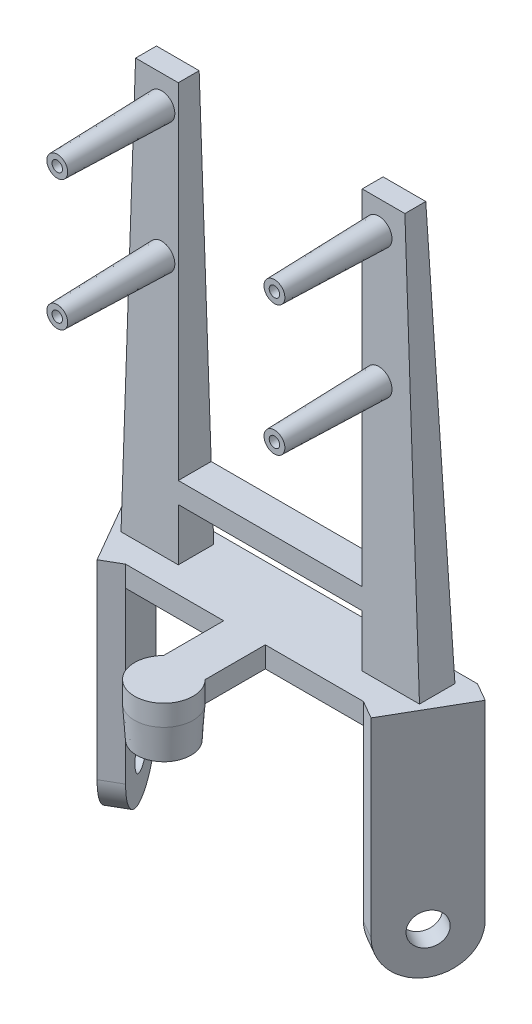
ISO-10303-21;
HEADER;
FILE_DESCRIPTION(('STEP AP214'),'2;1');
FILE_NAME('part.step','',(''),(''),'','','');
FILE_SCHEMA(('AUTOMOTIVE_DESIGN { 1 0 10303 214 1 1 1 1 }'));
ENDSEC;
DATA;
#1=APPLICATION_CONTEXT('core data for automotive mechanical design processes');
#2=APPLICATION_PROTOCOL_DEFINITION('international standard','automotive_design',2000,#1);
#3=PRODUCT_CONTEXT('',#1,'mechanical');
#4=PRODUCT('Part','Part','',(#3));
#5=PRODUCT_RELATED_PRODUCT_CATEGORY('part','',(#4));
#6=PRODUCT_DEFINITION_FORMATION('','',#4);
#7=PRODUCT_DEFINITION_CONTEXT('part definition',#1,'design');
#8=PRODUCT_DEFINITION('design','',#6,#7);
#9=PRODUCT_DEFINITION_SHAPE('','',#8);
#10=(LENGTH_UNIT() NAMED_UNIT(*) SI_UNIT(.MILLI.,.METRE.));
#11=(NAMED_UNIT(*) PLANE_ANGLE_UNIT() SI_UNIT($,.RADIAN.));
#12=(NAMED_UNIT(*) SI_UNIT($,.STERADIAN.) SOLID_ANGLE_UNIT());
#13=UNCERTAINTY_MEASURE_WITH_UNIT(LENGTH_MEASURE(1.E-05),#10,'distance_accuracy_value','');
#14=(GEOMETRIC_REPRESENTATION_CONTEXT(3) GLOBAL_UNCERTAINTY_ASSIGNED_CONTEXT((#13)) GLOBAL_UNIT_ASSIGNED_CONTEXT((#10,
#11,#12)) REPRESENTATION_CONTEXT('',''));
#15=CARTESIAN_POINT('',(0.,0.,0.));
#16=DIRECTION('',(0.,0.,1.));
#17=DIRECTION('',(1.,0.,0.));
#18=AXIS2_PLACEMENT_3D('',#15,#16,#17);
#19=CARTESIAN_POINT('',(-8.80937578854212,14.7347085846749,-24.1947583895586));
#20=DIRECTION('',(-1.,0.,0.));
#21=DIRECTION('',(0.,0.,1.));
#22=AXIS2_PLACEMENT_3D('',#19,#20,#21);
#23=PLANE('',#22);
#24=DIRECTION('',(0.,0.,-1.));
#25=VECTOR('',#24,1.);
#26=CARTESIAN_POINT('',(-8.80937578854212,23.25,-22.1947583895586));
#27=LINE('',#26,#25);
#28=CARTESIAN_POINT('',(-8.80937578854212,23.25,-22.1947583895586));
#29=VERTEX_POINT('',#28);
#30=CARTESIAN_POINT('',(-8.80937578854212,23.25,-25.4169853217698));
#31=VERTEX_POINT('',#30);
#32=EDGE_CURVE('E238',#29,#31,#27,.T.);
#33=ORIENTED_EDGE('',*,*,#32,.F.);
#34=DIRECTION('',(0.,1.,0.));
#35=VECTOR('',#34,1.);
#36=CARTESIAN_POINT('',(-8.80937578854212,14.7347085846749,-22.1947583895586));
#37=LINE('',#36,#35);
#38=CARTESIAN_POINT('',(-8.80937578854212,18.25,-22.1947583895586));
#39=VERTEX_POINT('',#38);
#40=EDGE_CURVE('E219',#39,#29,#37,.T.);
#41=ORIENTED_EDGE('',*,*,#40,.F.);
#42=DIRECTION('',(0.,0.,1.));
#43=VECTOR('',#42,1.);
#44=CARTESIAN_POINT('',(-8.80937578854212,18.25,-24.1947583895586));
#45=LINE('',#44,#43);
#46=CARTESIAN_POINT('',(-8.80937578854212,18.25,-25.5915891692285));
#47=VERTEX_POINT('',#46);
#48=EDGE_CURVE('E220',#47,#39,#45,.T.);
#49=ORIENTED_EDGE('',*,*,#48,.F.);
#50=DIRECTION('',(0.,0.999390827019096,0.034899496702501));
#51=VECTOR('',#50,1.);
#52=CARTESIAN_POINT('',(-8.80937578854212,58.25,-24.1947583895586));
#53=LINE('',#52,#51);
#54=EDGE_CURVE('E55',#31,#47,#53,.F.);
#55=ORIENTED_EDGE('',*,*,#54,.F.);
#56=EDGE_LOOP('',(#33,#41,#49,#55));
#57=FACE_BOUND('',#56,.T.);
#58=ADVANCED_FACE('F39',(#57),#23,.F.);
#59=DIRECTION('',(0.,0.,1.));
#60=VECTOR('',#59,1.);
#61=CARTESIAN_POINT('',(-8.80937578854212,25.2480319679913,-25.3472125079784));
#62=LINE('',#61,#60);
#63=CARTESIAN_POINT('',(-8.80937578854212,25.2480319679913,-25.3472125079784));
#64=VERTEX_POINT('',#63);
#65=CARTESIAN_POINT('',(-8.80937578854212,25.2480319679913,-22.1947583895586));
#66=VERTEX_POINT('',#65);
#67=EDGE_CURVE('E63',#64,#66,#62,.T.);
#68=ORIENTED_EDGE('',*,*,#67,.F.);
#69=CARTESIAN_POINT('',(-8.80937578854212,58.25,-24.1947583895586));
#70=VERTEX_POINT('',#69);
#71=EDGE_CURVE('E270',#70,#64,#53,.F.);
#72=ORIENTED_EDGE('',*,*,#71,.F.);
#73=DIRECTION('',(0.,0.,-1.));
#74=VECTOR('',#73,1.);
#75=CARTESIAN_POINT('',(-8.80937578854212,58.25,0.));
#76=LINE('',#75,#74);
#77=CARTESIAN_POINT('',(-8.80937578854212,58.25,-22.1947583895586));
#78=VERTEX_POINT('',#77);
#79=EDGE_CURVE('E215',#78,#70,#76,.T.);
#80=ORIENTED_EDGE('',*,*,#79,.F.);
#81=EDGE_CURVE('E211',#66,#78,#37,.T.);
#82=ORIENTED_EDGE('',*,*,#81,.F.);
#83=EDGE_LOOP('',(#68,#72,#80,#82));
#84=FACE_BOUND('',#83,.T.);
#85=ADVANCED_FACE('F213',(#84),#23,.F.);
#86=CARTESIAN_POINT('',(8.80937578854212,14.7347085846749,-24.1947583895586));
#87=DIRECTION('',(-1.,0.,0.));
#88=DIRECTION('',(0.,0.,1.));
#89=AXIS2_PLACEMENT_3D('',#86,#87,#88);
#90=PLANE('',#89);
#91=DIRECTION('',(0.,1.,0.));
#92=VECTOR('',#91,1.);
#93=CARTESIAN_POINT('',(8.80937578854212,14.7347085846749,-22.1947583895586));
#94=LINE('',#93,#92);
#95=CARTESIAN_POINT('',(8.80937578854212,18.25,-22.1947583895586));
#96=VERTEX_POINT('',#95);
#97=CARTESIAN_POINT('',(8.80937578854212,23.25,-22.1947583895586));
#98=VERTEX_POINT('',#97);
#99=EDGE_CURVE('E257',#96,#98,#94,.T.);
#100=ORIENTED_EDGE('',*,*,#99,.T.);
#101=DIRECTION('',(0.,0.,-1.));
#102=VECTOR('',#101,1.);
#103=CARTESIAN_POINT('',(8.80937578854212,23.25,-24.1947583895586));
#104=LINE('',#103,#102);
#105=CARTESIAN_POINT('',(8.80937578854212,23.25,-25.4169853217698));
#106=VERTEX_POINT('',#105);
#107=EDGE_CURVE('E11',#98,#106,#104,.T.);
#108=ORIENTED_EDGE('',*,*,#107,.T.);
#109=DIRECTION('',(0.,0.999390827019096,0.034899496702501));
#110=VECTOR('',#109,1.);
#111=CARTESIAN_POINT('',(8.80937578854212,58.25,-24.1947583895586));
#112=LINE('',#111,#110);
#113=CARTESIAN_POINT('',(8.80937578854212,18.25,-25.5915891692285));
#114=VERTEX_POINT('',#113);
#115=EDGE_CURVE('E261',#114,#106,#112,.T.);
#116=ORIENTED_EDGE('',*,*,#115,.F.);
#117=DIRECTION('',(0.,0.,1.));
#118=VECTOR('',#117,1.);
#119=CARTESIAN_POINT('',(8.80937578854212,18.25,-24.1947583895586));
#120=LINE('',#119,#118);
#121=EDGE_CURVE('E253',#114,#96,#120,.T.);
#122=ORIENTED_EDGE('',*,*,#121,.T.);
#123=EDGE_LOOP('',(#100,#108,#116,#122));
#124=FACE_BOUND('',#123,.T.);
#125=ADVANCED_FACE('F602',(#124),#90,.T.);
#126=CARTESIAN_POINT('',(8.80937578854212,25.2480319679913,-25.3472125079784));
#127=VERTEX_POINT('',#126);
#128=CARTESIAN_POINT('',(8.80937578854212,58.25,-24.1947583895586));
#129=VERTEX_POINT('',#128);
#130=EDGE_CURVE('E256',#127,#129,#112,.T.);
#131=ORIENTED_EDGE('',*,*,#130,.F.);
#132=DIRECTION('',(0.,0.,1.));
#133=VECTOR('',#132,1.);
#134=CARTESIAN_POINT('',(8.80937578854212,25.2480319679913,-24.1947583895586));
#135=LINE('',#134,#133);
#136=CARTESIAN_POINT('',(8.80937578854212,25.2480319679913,-22.1947583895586));
#137=VERTEX_POINT('',#136);
#138=EDGE_CURVE('E48',#127,#137,#135,.T.);
#139=ORIENTED_EDGE('',*,*,#138,.T.);
#140=CARTESIAN_POINT('',(8.80937578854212,58.25,-22.1947583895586));
#141=VERTEX_POINT('',#140);
#142=EDGE_CURVE('E228',#137,#141,#94,.T.);
#143=ORIENTED_EDGE('',*,*,#142,.T.);
#144=DIRECTION('',(0.,0.,-1.));
#145=VECTOR('',#144,1.);
#146=CARTESIAN_POINT('',(8.80937578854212,58.25,0.));
#147=LINE('',#146,#145);
#148=EDGE_CURVE('E576',#141,#129,#147,.T.);
#149=ORIENTED_EDGE('',*,*,#148,.T.);
#150=EDGE_LOOP('',(#131,#139,#143,#149));
#151=FACE_BOUND('',#150,.T.);
#152=ADVANCED_FACE('F582',(#151),#90,.T.);
#153=CARTESIAN_POINT('',(0.,58.25,0.));
#154=DIRECTION('',(0.,-1.,0.));
#155=DIRECTION('',(0.,0.,-1.));
#156=AXIS2_PLACEMENT_3D('',#153,#154,#155);
#157=PLANE('',#156);
#158=ORIENTED_EDGE('',*,*,#148,.F.);
#159=DIRECTION('',(-1.,0.,0.));
#160=VECTOR('',#159,1.);
#161=CARTESIAN_POINT('',(12.8992245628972,58.25,-22.1947583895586));
#162=LINE('',#161,#160);
#163=CARTESIAN_POINT('',(12.8992245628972,58.25,-22.1947583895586));
#164=VERTEX_POINT('',#163);
#165=EDGE_CURVE('E306',#164,#141,#162,.T.);
#166=ORIENTED_EDGE('',*,*,#165,.F.);
#167=DIRECTION('',(0.,0.,1.));
#168=VECTOR('',#167,1.);
#169=CARTESIAN_POINT('',(12.8992245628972,58.25,-22.1947583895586));
#170=LINE('',#169,#168);
#171=CARTESIAN_POINT('',(12.8992245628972,58.25,-24.1947583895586));
#172=VERTEX_POINT('',#171);
#173=EDGE_CURVE('E298',#172,#164,#170,.T.);
#174=ORIENTED_EDGE('',*,*,#173,.F.);
#175=DIRECTION('',(1.,0.,0.));
#176=VECTOR('',#175,1.);
#177=CARTESIAN_POINT('',(12.8992245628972,58.25,-24.1947583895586));
#178=LINE('',#177,#176);
#179=EDGE_CURVE('E302',#129,#172,#178,.T.);
#180=ORIENTED_EDGE('',*,*,#179,.F.);
#181=EDGE_LOOP('',(#158,#166,#174,#180));
#182=FACE_BOUND('',#181,.T.);
#183=ADVANCED_FACE('F616',(#182),#157,.F.);
#184=CARTESIAN_POINT('',(0.,18.25,-12.));
#185=DIRECTION('',(0.,-1.,0.));
#186=DIRECTION('',(0.,0.,-1.));
#187=AXIS2_PLACEMENT_3D('',#184,#185,#186);
#188=PLANE('',#187);
#189=ORIENTED_EDGE('',*,*,#121,.F.);
#190=DIRECTION('',(1.,0.,0.));
#191=VECTOR('',#190,1.);
#192=CARTESIAN_POINT('',(0.,18.25,-25.5915891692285));
#193=LINE('',#192,#191);
#194=CARTESIAN_POINT('',(14.2960553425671,18.25,-25.5915891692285));
#195=VERTEX_POINT('',#194);
#196=EDGE_CURVE('E313',#114,#195,#193,.T.);
#197=ORIENTED_EDGE('',*,*,#196,.T.);
#198=DIRECTION('',(0.,0.,1.));
#199=VECTOR('',#198,1.);
#200=CARTESIAN_POINT('',(14.2960553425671,18.25,-12.));
#201=LINE('',#200,#199);
#202=CARTESIAN_POINT('',(14.2960553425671,18.25,-22.1947583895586));
#203=VERTEX_POINT('',#202);
#204=EDGE_CURVE('E297',#195,#203,#201,.T.);
#205=ORIENTED_EDGE('',*,*,#204,.T.);
#206=DIRECTION('',(-1.,0.,0.));
#207=VECTOR('',#206,1.);
#208=CARTESIAN_POINT('',(12.8992245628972,18.25,-22.1947583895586));
#209=LINE('',#208,#207);
#210=EDGE_CURVE('E303',#203,#96,#209,.T.);
#211=ORIENTED_EDGE('',*,*,#210,.T.);
#212=EDGE_LOOP('',(#189,#197,#205,#211));
#213=FACE_BOUND('',#212,.T.);
#214=DIRECTION('',(0.500000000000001,0.,0.866025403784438));
#215=VECTOR('',#214,1.);
#216=CARTESIAN_POINT('',(-13.1235508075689,18.25,-18.7306567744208));
#217=LINE('',#216,#215);
#218=CARTESIAN_POINT('',(-17.1235508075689,18.25,-25.6588600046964));
#219=VERTEX_POINT('',#218);
#220=CARTESIAN_POINT('',(-13.1235508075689,18.25,-18.7306567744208));
#221=VERTEX_POINT('',#220);
#222=EDGE_CURVE('E399',#219,#221,#217,.T.);
#223=ORIENTED_EDGE('',*,*,#222,.T.);
#224=DIRECTION('',(0.866025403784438,0.,-0.500000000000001));
#225=VECTOR('',#224,1.);
#226=CARTESIAN_POINT('',(-11.3915,18.25,-19.7306567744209));
#227=LINE('',#226,#225);
#228=CARTESIAN_POINT('',(-11.3915,18.25,-19.7306567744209));
#229=VERTEX_POINT('',#228);
#230=EDGE_CURVE('E403',#221,#229,#227,.T.);
#231=ORIENTED_EDGE('',*,*,#230,.T.);
#232=DIRECTION('',(1.,0.,0.));
#233=VECTOR('',#232,1.);
#234=CARTESIAN_POINT('',(-11.3915,18.25,-19.7306567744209));
#235=LINE('',#234,#233);
#236=CARTESIAN_POINT('',(-1.99408198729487,18.25,-19.7306567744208));
#237=VERTEX_POINT('',#236);
#238=EDGE_CURVE('E407',#229,#237,#235,.T.);
#239=ORIENTED_EDGE('',*,*,#238,.T.);
#240=DIRECTION('',(0.,0.,1.));
#241=VECTOR('',#240,1.);
#242=CARTESIAN_POINT('',(-1.99408198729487,18.25,-13.96561365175));
#243=LINE('',#242,#241);
#244=CARTESIAN_POINT('',(-1.99408198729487,18.25,-13.96561365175));
#245=VERTEX_POINT('',#244);
#246=EDGE_CURVE('E410',#237,#245,#243,.T.);
#247=ORIENTED_EDGE('',*,*,#246,.T.);
#248=CARTESIAN_POINT('',(0.,18.25,-12.));
#249=DIRECTION('',(0.,1.,0.));
#250=DIRECTION('',(0.,0.,-1.));
#251=AXIS2_PLACEMENT_3D('',#248,#249,#250);
#252=CIRCLE('',#251,2.8);
#253=CARTESIAN_POINT('',(1.99408198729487,18.25,-13.96561365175));
#254=VERTEX_POINT('',#253);
#255=EDGE_CURVE('E413',#245,#254,#252,.T.);
#256=ORIENTED_EDGE('',*,*,#255,.T.);
#257=DIRECTION('',(0.,0.,-1.));
#258=VECTOR('',#257,1.);
#259=CARTESIAN_POINT('',(1.99408198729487,18.25,-19.7306567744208));
#260=LINE('',#259,#258);
#261=CARTESIAN_POINT('',(1.99408198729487,18.25,-19.7306567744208));
#262=VERTEX_POINT('',#261);
#263=EDGE_CURVE('E416',#254,#262,#260,.T.);
#264=ORIENTED_EDGE('',*,*,#263,.T.);
#265=DIRECTION('',(1.,0.,0.));
#266=VECTOR('',#265,1.);
#267=CARTESIAN_POINT('',(1.99408198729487,18.25,-19.7306567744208));
#268=LINE('',#267,#266);
#269=CARTESIAN_POINT('',(11.3915,18.25,-19.7306567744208));
#270=VERTEX_POINT('',#269);
#271=EDGE_CURVE('E419',#262,#270,#268,.T.);
#272=ORIENTED_EDGE('',*,*,#271,.T.);
#273=DIRECTION('',(0.866025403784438,0.,0.500000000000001));
#274=VECTOR('',#273,1.);
#275=CARTESIAN_POINT('',(13.1235508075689,18.25,-18.7306567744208));
#276=LINE('',#275,#274);
#277=CARTESIAN_POINT('',(13.1235508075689,18.25,-18.7306567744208));
#278=VERTEX_POINT('',#277);
#279=EDGE_CURVE('E422',#270,#278,#276,.T.);
#280=ORIENTED_EDGE('',*,*,#279,.T.);
#281=DIRECTION('',(0.500000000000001,0.,-0.866025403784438));
#282=VECTOR('',#281,1.);
#283=CARTESIAN_POINT('',(17.1235508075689,18.25,-25.6588600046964));
#284=LINE('',#283,#282);
#285=CARTESIAN_POINT('',(17.1235508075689,18.25,-25.6588600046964));
#286=VERTEX_POINT('',#285);
#287=EDGE_CURVE('E426',#278,#286,#284,.T.);
#288=ORIENTED_EDGE('',*,*,#287,.T.);
#289=DIRECTION('',(-0.866025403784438,0.,-0.5));
#290=VECTOR('',#289,1.);
#291=CARTESIAN_POINT('',(15.3915,18.25,-26.6588600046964));
#292=LINE('',#291,#290);
#293=CARTESIAN_POINT('',(15.3915,18.25,-26.6588600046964));
#294=VERTEX_POINT('',#293);
#295=EDGE_CURVE('E430',#286,#294,#292,.T.);
#296=ORIENTED_EDGE('',*,*,#295,.T.);
#297=DIRECTION('',(-1.,0.,0.));
#298=VECTOR('',#297,1.);
#299=CARTESIAN_POINT('',(-15.3915,18.25,-26.6588600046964));
#300=LINE('',#299,#298);
#301=CARTESIAN_POINT('',(-15.3915,18.25,-26.6588600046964));
#302=VERTEX_POINT('',#301);
#303=EDGE_CURVE('E433',#294,#302,#300,.T.);
#304=ORIENTED_EDGE('',*,*,#303,.T.);
#305=DIRECTION('',(-0.866025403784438,0.,0.5));
#306=VECTOR('',#305,1.);
#307=CARTESIAN_POINT('',(-17.1235508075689,18.25,-25.6588600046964));
#308=LINE('',#307,#306);
#309=EDGE_CURVE('E436',#302,#219,#308,.T.);
#310=ORIENTED_EDGE('',*,*,#309,.T.);
#311=EDGE_LOOP('',(#223,#231,#239,#247,#256,#264,#272,#280,#288,#296,#304,#310));
#312=FACE_BOUND('',#311,.T.);
#313=DIRECTION('',(1.,0.,0.));
#314=VECTOR('',#313,1.);
#315=CARTESIAN_POINT('',(-12.8992245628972,18.25,-22.1947583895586));
#316=LINE('',#315,#314);
#317=CARTESIAN_POINT('',(-14.2960553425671,18.25,-22.1947583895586));
#318=VERTEX_POINT('',#317);
#319=EDGE_CURVE('E339',#318,#39,#316,.T.);
#320=ORIENTED_EDGE('',*,*,#319,.F.);
#321=DIRECTION('',(0.,0.,-1.));
#322=VECTOR('',#321,1.);
#323=CARTESIAN_POINT('',(-14.2960553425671,18.25,-12.));
#324=LINE('',#323,#322);
#325=CARTESIAN_POINT('',(-14.2960553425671,18.25,-25.5915891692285));
#326=VERTEX_POINT('',#325);
#327=EDGE_CURVE('E345',#326,#318,#324,.F.);
#328=ORIENTED_EDGE('',*,*,#327,.F.);
#329=DIRECTION('',(1.,0.,0.));
#330=VECTOR('',#329,1.);
#331=CARTESIAN_POINT('',(0.,18.25,-25.5915891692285));
#332=LINE('',#331,#330);
#333=EDGE_CURVE('E355',#47,#326,#332,.F.);
#334=ORIENTED_EDGE('',*,*,#333,.F.);
#335=ORIENTED_EDGE('',*,*,#48,.T.);
#336=EDGE_LOOP('',(#320,#328,#334,#335));
#337=FACE_BOUND('',#336,.T.);
#338=ADVANCED_FACE('F597',(#213,#312,#337),#188,.F.);
#339=CARTESIAN_POINT('',(15.1235508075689,0.,-22.1947583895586));
#340=DIRECTION('',(-0.866025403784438,0.,-0.500000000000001));
#341=DIRECTION('',(-0.500000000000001,0.,0.866025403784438));
#342=AXIS2_PLACEMENT_3D('',#339,#340,#341);
#343=CYLINDRICAL_SURFACE('',#342,4.);
#344=CARTESIAN_POINT('',(13.3915,0.,-23.1947583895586));
#345=DIRECTION('',(0.866025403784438,0.,0.500000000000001));
#346=DIRECTION('',(-0.500000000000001,0.,0.866025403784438));
#347=AXIS2_PLACEMENT_3D('',#344,#345,#346);
#348=CIRCLE('',#347,4.);
#349=CARTESIAN_POINT('',(11.3915,0.,-19.7306567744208));
#350=VERTEX_POINT('',#349);
#351=CARTESIAN_POINT('',(15.3915,0.,-26.6588600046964));
#352=VERTEX_POINT('',#351);
#353=EDGE_CURVE('E502',#350,#352,#348,.T.);
#354=ORIENTED_EDGE('',*,*,#353,.T.);
#355=DIRECTION('',(-0.866025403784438,0.,-0.500000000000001));
#356=VECTOR('',#355,1.);
#357=CARTESIAN_POINT('',(17.1235508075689,0.,-25.6588600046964));
#358=LINE('',#357,#356);
#359=CARTESIAN_POINT('',(17.1235508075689,0.,-25.6588600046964));
#360=VERTEX_POINT('',#359);
#361=EDGE_CURVE('E533',#360,#352,#358,.T.);
#362=ORIENTED_EDGE('',*,*,#361,.F.);
#363=CARTESIAN_POINT('',(15.1235508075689,0.,-22.1947583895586));
#364=DIRECTION('',(0.866025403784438,0.,0.500000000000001));
#365=DIRECTION('',(-0.500000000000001,0.,0.866025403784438));
#366=AXIS2_PLACEMENT_3D('',#363,#364,#365);
#367=CIRCLE('',#366,4.);
#368=CARTESIAN_POINT('',(13.1235508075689,0.,-18.7306567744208));
#369=VERTEX_POINT('',#368);
#370=EDGE_CURVE('E506',#369,#360,#367,.T.);
#371=ORIENTED_EDGE('',*,*,#370,.F.);
#372=DIRECTION('',(-0.866025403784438,0.,-0.500000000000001));
#373=VECTOR('',#372,1.);
#374=CARTESIAN_POINT('',(13.1235508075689,0.,-18.7306567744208));
#375=LINE('',#374,#373);
#376=EDGE_CURVE('E517',#369,#350,#375,.T.);
#377=ORIENTED_EDGE('',*,*,#376,.T.);
#378=EDGE_LOOP('',(#354,#362,#371,#377));
#379=FACE_BOUND('',#378,.T.);
#380=ADVANCED_FACE('F623',(#379),#343,.T.);
#381=CARTESIAN_POINT('',(17.1235508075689,16.25,-25.6588600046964));
#382=DIRECTION('',(-0.500000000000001,0.,0.866025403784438));
#383=DIRECTION('',(0.866025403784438,0.,0.500000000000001));
#384=AXIS2_PLACEMENT_3D('',#381,#382,#383);
#385=PLANE('',#384);
#386=DIRECTION('',(0.,1.,0.));
#387=VECTOR('',#386,1.);
#388=CARTESIAN_POINT('',(15.3915,16.25,-26.6588600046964));
#389=LINE('',#388,#387);
#390=CARTESIAN_POINT('',(15.3915,16.25,-26.6588600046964));
#391=VERTEX_POINT('',#390);
#392=EDGE_CURVE('E521',#352,#391,#389,.T.);
#393=ORIENTED_EDGE('',*,*,#392,.T.);
#394=DIRECTION('',(0.,-1.,0.));
#395=VECTOR('',#394,1.);
#396=CARTESIAN_POINT('',(15.3915,18.25,-26.6588600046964));
#397=LINE('',#396,#395);
#398=EDGE_CURVE('E466',#294,#391,#397,.T.);
#399=ORIENTED_EDGE('',*,*,#398,.F.);
#400=ORIENTED_EDGE('',*,*,#295,.F.);
#401=DIRECTION('',(0.,1.,0.));
#402=VECTOR('',#401,1.);
#403=CARTESIAN_POINT('',(17.1235508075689,16.25,-25.6588600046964));
#404=LINE('',#403,#402);
#405=EDGE_CURVE('E510',#360,#286,#404,.T.);
#406=ORIENTED_EDGE('',*,*,#405,.F.);
#407=ORIENTED_EDGE('',*,*,#361,.T.);
#408=EDGE_LOOP('',(#393,#399,#400,#406,#407));
#409=FACE_BOUND('',#408,.T.);
#410=ADVANCED_FACE('F755',(#409),#385,.F.);
#411=CARTESIAN_POINT('',(13.1235508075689,0.,-18.7306567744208));
#412=DIRECTION('',(0.500000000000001,0.,-0.866025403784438));
#413=DIRECTION('',(-0.866025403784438,0.,-0.500000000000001));
#414=AXIS2_PLACEMENT_3D('',#411,#412,#413);
#415=PLANE('',#414);
#416=DIRECTION('',(0.,-1.,0.));
#417=VECTOR('',#416,1.);
#418=CARTESIAN_POINT('',(11.3915,0.,-19.7306567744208));
#419=LINE('',#418,#417);
#420=CARTESIAN_POINT('',(11.3915,16.25,-19.7306567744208));
#421=VERTEX_POINT('',#420);
#422=EDGE_CURVE('E511',#421,#350,#419,.T.);
#423=ORIENTED_EDGE('',*,*,#422,.T.);
#424=ORIENTED_EDGE('',*,*,#376,.F.);
#425=DIRECTION('',(0.,-1.,0.));
#426=VECTOR('',#425,1.);
#427=CARTESIAN_POINT('',(13.1235508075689,0.,-18.7306567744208));
#428=LINE('',#427,#426);
#429=EDGE_CURVE('E514',#278,#369,#428,.T.);
#430=ORIENTED_EDGE('',*,*,#429,.F.);
#431=ORIENTED_EDGE('',*,*,#279,.F.);
#432=DIRECTION('',(0.,-1.,0.));
#433=VECTOR('',#432,1.);
#434=CARTESIAN_POINT('',(11.3915,18.25,-19.7306567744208));
#435=LINE('',#434,#433);
#436=EDGE_CURVE('E470',#270,#421,#435,.T.);
#437=ORIENTED_EDGE('',*,*,#436,.T.);
#438=EDGE_LOOP('',(#423,#424,#430,#431,#437));
#439=FACE_BOUND('',#438,.T.);
#440=ADVANCED_FACE('F748',(#439),#415,.F.);
#441=CARTESIAN_POINT('',(15.1235508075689,0.,-22.1947583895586));
#442=DIRECTION('',(-0.866025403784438,0.,-0.500000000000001));
#443=DIRECTION('',(-0.500000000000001,0.,0.866025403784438));
#444=AXIS2_PLACEMENT_3D('',#441,#442,#443);
#445=PLANE('',#444);
#446=CARTESIAN_POINT('',(15.1235508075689,0.,-22.1947583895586));
#447=DIRECTION('',(-0.866025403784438,0.,-0.500000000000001));
#448=DIRECTION('',(-0.500000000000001,0.,0.866025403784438));
#449=AXIS2_PLACEMENT_3D('',#446,#447,#448);
#450=CIRCLE('',#449,1.55);
#451=CARTESIAN_POINT('',(14.3485508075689,0.,-20.8524190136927));
#452=VERTEX_POINT('',#451);
#453=EDGE_CURVE('E498',#452,#452,#450,.T.);
#454=ORIENTED_EDGE('',*,*,#453,.T.);
#455=EDGE_LOOP('',(#454));
#456=FACE_BOUND('',#455,.T.);
#457=ORIENTED_EDGE('',*,*,#370,.T.);
#458=ORIENTED_EDGE('',*,*,#405,.T.);
#459=ORIENTED_EDGE('',*,*,#287,.F.);
#460=ORIENTED_EDGE('',*,*,#429,.T.);
#461=EDGE_LOOP('',(#457,#458,#459,#460));
#462=FACE_BOUND('',#461,.T.);
#463=ADVANCED_FACE('F745',(#456,#462),#445,.F.);
#464=CARTESIAN_POINT('',(13.3915,0.,-23.1947583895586));
#465=DIRECTION('',(-0.866025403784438,0.,-0.500000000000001));
#466=DIRECTION('',(-0.500000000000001,0.,0.866025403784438));
#467=AXIS2_PLACEMENT_3D('',#464,#465,#466);
#468=PLANE('',#467);
#469=CARTESIAN_POINT('',(13.3915,0.,-23.1947583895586));
#470=DIRECTION('',(-0.866025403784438,0.,-0.500000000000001));
#471=DIRECTION('',(-0.500000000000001,0.,0.866025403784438));
#472=AXIS2_PLACEMENT_3D('',#469,#470,#471);
#473=CIRCLE('',#472,1.55);
#474=CARTESIAN_POINT('',(12.6165,0.,-21.8524190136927));
#475=VERTEX_POINT('',#474);
#476=EDGE_CURVE('E497',#475,#475,#473,.T.);
#477=ORIENTED_EDGE('',*,*,#476,.F.);
#478=EDGE_LOOP('',(#477));
#479=FACE_BOUND('',#478,.T.);
#480=ORIENTED_EDGE('',*,*,#353,.F.);
#481=ORIENTED_EDGE('',*,*,#422,.F.);
#482=DIRECTION('',(-0.500000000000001,0.,0.866025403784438));
#483=VECTOR('',#482,1.);
#484=CARTESIAN_POINT('',(11.3915,16.25,-19.7306567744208));
#485=LINE('',#484,#483);
#486=EDGE_CURVE('E524',#391,#421,#485,.T.);
#487=ORIENTED_EDGE('',*,*,#486,.F.);
#488=ORIENTED_EDGE('',*,*,#392,.F.);
#489=EDGE_LOOP('',(#480,#481,#487,#488));
#490=FACE_BOUND('',#489,.T.);
#491=ADVANCED_FACE('F743',(#479,#490),#468,.T.);
#492=CARTESIAN_POINT('',(15.1235508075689,0.,-22.1947583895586));
#493=DIRECTION('',(-0.866025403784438,0.,-0.500000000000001));
#494=DIRECTION('',(-0.500000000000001,0.,0.866025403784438));
#495=AXIS2_PLACEMENT_3D('',#492,#493,#494);
#496=CYLINDRICAL_SURFACE('',#495,1.55);
#497=ORIENTED_EDGE('',*,*,#453,.F.);
#498=EDGE_LOOP('',(#497));
#499=FACE_BOUND('',#498,.T.);
#500=ORIENTED_EDGE('',*,*,#476,.T.);
#501=EDGE_LOOP('',(#500));
#502=FACE_BOUND('',#501,.T.);
#503=ADVANCED_FACE('F739',(#499,#502),#496,.F.);
#504=CARTESIAN_POINT('',(-13.1235508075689,18.25,-18.7306567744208));
#505=DIRECTION('',(0.866025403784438,0.,-0.500000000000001));
#506=DIRECTION('',(-0.500000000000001,0.,-0.866025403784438));
#507=AXIS2_PLACEMENT_3D('',#504,#505,#506);
#508=PLANE('',#507);
#509=DIRECTION('',(0.,-1.,0.));
#510=VECTOR('',#509,1.);
#511=CARTESIAN_POINT('',(-17.1235508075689,18.25,-25.6588600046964));
#512=LINE('',#511,#510);
#513=CARTESIAN_POINT('',(-17.1235508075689,0.,-25.6588600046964));
#514=VERTEX_POINT('',#513);
#515=EDGE_CURVE('E439',#219,#514,#512,.T.);
#516=ORIENTED_EDGE('',*,*,#515,.T.);
#517=CARTESIAN_POINT('',(-15.1235508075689,0.,-22.1947583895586));
#518=DIRECTION('',(-0.866025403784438,0.,0.500000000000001));
#519=DIRECTION('',(-0.500000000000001,0.,-0.866025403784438));
#520=AXIS2_PLACEMENT_3D('',#517,#518,#519);
#521=CIRCLE('',#520,4.);
#522=CARTESIAN_POINT('',(-13.1235508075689,0.,-18.7306567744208));
#523=VERTEX_POINT('',#522);
#524=EDGE_CURVE('E373',#514,#523,#521,.T.);
#525=ORIENTED_EDGE('',*,*,#524,.T.);
#526=DIRECTION('',(0.,-1.,0.));
#527=VECTOR('',#526,1.);
#528=CARTESIAN_POINT('',(-13.1235508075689,18.25,-18.7306567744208));
#529=LINE('',#528,#527);
#530=EDGE_CURVE('E494',#221,#523,#529,.T.);
#531=ORIENTED_EDGE('',*,*,#530,.F.);
#532=ORIENTED_EDGE('',*,*,#222,.F.);
#533=EDGE_LOOP('',(#516,#525,#531,#532));
#534=FACE_BOUND('',#533,.T.);
#535=CARTESIAN_POINT('',(-15.1235508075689,0.,-22.1947583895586));
#536=DIRECTION('',(0.866025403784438,0.,-0.500000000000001));
#537=DIRECTION('',(-0.500000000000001,0.,-0.866025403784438));
#538=AXIS2_PLACEMENT_3D('',#535,#536,#537);
#539=CIRCLE('',#538,1.55);
#540=CARTESIAN_POINT('',(-15.8985508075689,0.,-23.5370977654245));
#541=VERTEX_POINT('',#540);
#542=EDGE_CURVE('E365',#541,#541,#539,.T.);
#543=ORIENTED_EDGE('',*,*,#542,.T.);
#544=EDGE_LOOP('',(#543));
#545=FACE_BOUND('',#544,.T.);
#546=ADVANCED_FACE('F735',(#534,#545),#508,.F.);
#547=CARTESIAN_POINT('',(-11.3915,18.25,-19.7306567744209));
#548=DIRECTION('',(-0.500000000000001,0.,-0.866025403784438));
#549=DIRECTION('',(-0.866025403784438,0.,0.500000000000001));
#550=AXIS2_PLACEMENT_3D('',#547,#548,#549);
#551=PLANE('',#550);
#552=ORIENTED_EDGE('',*,*,#530,.T.);
#553=DIRECTION('',(0.866025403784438,0.,-0.500000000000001));
#554=VECTOR('',#553,1.);
#555=CARTESIAN_POINT('',(-13.1235508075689,0.,-18.7306567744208));
#556=LINE('',#555,#554);
#557=CARTESIAN_POINT('',(-11.3915,0.,-19.7306567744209));
#558=VERTEX_POINT('',#557);
#559=EDGE_CURVE('E394',#523,#558,#556,.T.);
#560=ORIENTED_EDGE('',*,*,#559,.T.);
#561=DIRECTION('',(0.,1.,0.));
#562=VECTOR('',#561,1.);
#563=CARTESIAN_POINT('',(-11.3915,0.,-19.7306567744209));
#564=LINE('',#563,#562);
#565=CARTESIAN_POINT('',(-11.3915,16.25,-19.7306567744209));
#566=VERTEX_POINT('',#565);
#567=EDGE_CURVE('E382',#558,#566,#564,.T.);
#568=ORIENTED_EDGE('',*,*,#567,.T.);
#569=DIRECTION('',(0.,-1.,0.));
#570=VECTOR('',#569,1.);
#571=CARTESIAN_POINT('',(-11.3915,18.25,-19.7306567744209));
#572=LINE('',#571,#570);
#573=EDGE_CURVE('E490',#229,#566,#572,.T.);
#574=ORIENTED_EDGE('',*,*,#573,.F.);
#575=ORIENTED_EDGE('',*,*,#230,.F.);
#576=EDGE_LOOP('',(#552,#560,#568,#574,#575));
#577=FACE_BOUND('',#576,.T.);
#578=ADVANCED_FACE('F731',(#577),#551,.F.);
#579=CARTESIAN_POINT('',(-11.3915,18.25,-19.7306567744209));
#580=DIRECTION('',(0.,0.,-1.));
#581=DIRECTION('',(-1.,0.,0.));
#582=AXIS2_PLACEMENT_3D('',#579,#580,#581);
#583=PLANE('',#582);
#584=DIRECTION('',(1.,0.,0.));
#585=VECTOR('',#584,1.);
#586=CARTESIAN_POINT('',(-11.3915,16.25,-19.7306567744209));
#587=LINE('',#586,#585);
#588=CARTESIAN_POINT('',(-1.99408198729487,16.25,-19.7306567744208));
#589=VERTEX_POINT('',#588);
#590=EDGE_CURVE('E398',#566,#589,#587,.T.);
#591=ORIENTED_EDGE('',*,*,#590,.T.);
#592=DIRECTION('',(0.,-1.,0.));
#593=VECTOR('',#592,1.);
#594=CARTESIAN_POINT('',(-1.99408198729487,18.25,-19.7306567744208));
#595=LINE('',#594,#593);
#596=EDGE_CURVE('E486',#237,#589,#595,.T.);
#597=ORIENTED_EDGE('',*,*,#596,.F.);
#598=ORIENTED_EDGE('',*,*,#238,.F.);
#599=ORIENTED_EDGE('',*,*,#573,.T.);
#600=EDGE_LOOP('',(#591,#597,#598,#599));
#601=FACE_BOUND('',#600,.T.);
#602=ADVANCED_FACE('F727',(#601),#583,.F.);
#603=CARTESIAN_POINT('',(-1.99408198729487,18.25,-13.96561365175));
#604=DIRECTION('',(1.,0.,0.));
#605=DIRECTION('',(0.,0.,-1.));
#606=AXIS2_PLACEMENT_3D('',#603,#604,#605);
#607=PLANE('',#606);
#608=DIRECTION('',(0.,0.,1.));
#609=VECTOR('',#608,1.);
#610=CARTESIAN_POINT('',(-1.99408198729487,16.25,-13.96561365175));
#611=LINE('',#610,#609);
#612=CARTESIAN_POINT('',(-1.99408198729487,16.25,-13.96561365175));
#613=VERTEX_POINT('',#612);
#614=EDGE_CURVE('E442',#589,#613,#611,.T.);
#615=ORIENTED_EDGE('',*,*,#614,.T.);
#616=DIRECTION('',(0.,-1.,0.));
#617=VECTOR('',#616,1.);
#618=CARTESIAN_POINT('',(-1.99408198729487,18.25,-13.96561365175));
#619=LINE('',#618,#617);
#620=EDGE_CURVE('E482',#245,#613,#619,.T.);
#621=ORIENTED_EDGE('',*,*,#620,.F.);
#622=ORIENTED_EDGE('',*,*,#246,.F.);
#623=ORIENTED_EDGE('',*,*,#596,.T.);
#624=EDGE_LOOP('',(#615,#621,#622,#623));
#625=FACE_BOUND('',#624,.T.);
#626=ADVANCED_FACE('F723',(#625),#607,.F.);
#627=CARTESIAN_POINT('',(0.,18.25,-12.));
#628=DIRECTION('',(0.,-1.,0.));
#629=DIRECTION('',(0.,0.,-1.));
#630=AXIS2_PLACEMENT_3D('',#627,#628,#629);
#631=CYLINDRICAL_SURFACE('',#630,2.8);
#632=CARTESIAN_POINT('',(0.,16.25,-12.));
#633=DIRECTION('',(0.,1.,0.));
#634=DIRECTION('',(0.,0.,-1.));
#635=AXIS2_PLACEMENT_3D('',#632,#633,#634);
#636=CIRCLE('',#635,2.8);
#637=CARTESIAN_POINT('',(1.99408198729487,16.25,-13.96561365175));
#638=VERTEX_POINT('',#637);
#639=EDGE_CURVE('E446',#613,#638,#636,.T.);
#640=ORIENTED_EDGE('',*,*,#639,.T.);
#641=DIRECTION('',(0.,-1.,0.));
#642=VECTOR('',#641,1.);
#643=CARTESIAN_POINT('',(1.99408198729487,18.25,-13.96561365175));
#644=LINE('',#643,#642);
#645=EDGE_CURVE('E478',#254,#638,#644,.T.);
#646=ORIENTED_EDGE('',*,*,#645,.F.);
#647=ORIENTED_EDGE('',*,*,#255,.F.);
#648=ORIENTED_EDGE('',*,*,#620,.T.);
#649=EDGE_LOOP('',(#640,#646,#647,#648));
#650=FACE_BOUND('',#649,.T.);
#651=ADVANCED_FACE('F719',(#650),#631,.T.);
#652=CARTESIAN_POINT('',(1.99408198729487,18.25,-19.7306567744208));
#653=DIRECTION('',(-1.,0.,0.));
#654=DIRECTION('',(0.,0.,1.));
#655=AXIS2_PLACEMENT_3D('',#652,#653,#654);
#656=PLANE('',#655);
#657=DIRECTION('',(0.,0.,-1.));
#658=VECTOR('',#657,1.);
#659=CARTESIAN_POINT('',(1.99408198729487,16.25,-19.7306567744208));
#660=LINE('',#659,#658);
#661=CARTESIAN_POINT('',(1.99408198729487,16.25,-19.7306567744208));
#662=VERTEX_POINT('',#661);
#663=EDGE_CURVE('E450',#638,#662,#660,.T.);
#664=ORIENTED_EDGE('',*,*,#663,.T.);
#665=DIRECTION('',(0.,-1.,0.));
#666=VECTOR('',#665,1.);
#667=CARTESIAN_POINT('',(1.99408198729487,18.25,-19.7306567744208));
#668=LINE('',#667,#666);
#669=EDGE_CURVE('E474',#262,#662,#668,.T.);
#670=ORIENTED_EDGE('',*,*,#669,.F.);
#671=ORIENTED_EDGE('',*,*,#263,.F.);
#672=ORIENTED_EDGE('',*,*,#645,.T.);
#673=EDGE_LOOP('',(#664,#670,#671,#672));
#674=FACE_BOUND('',#673,.T.);
#675=ADVANCED_FACE('F715',(#674),#656,.F.);
#676=CARTESIAN_POINT('',(1.99408198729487,18.25,-19.7306567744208));
#677=DIRECTION('',(0.,0.,-1.));
#678=DIRECTION('',(-1.,0.,0.));
#679=AXIS2_PLACEMENT_3D('',#676,#677,#678);
#680=PLANE('',#679);
#681=DIRECTION('',(1.,0.,0.));
#682=VECTOR('',#681,1.);
#683=CARTESIAN_POINT('',(1.99408198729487,16.25,-19.7306567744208));
#684=LINE('',#683,#682);
#685=EDGE_CURVE('E453',#662,#421,#684,.T.);
#686=ORIENTED_EDGE('',*,*,#685,.T.);
#687=ORIENTED_EDGE('',*,*,#436,.F.);
#688=ORIENTED_EDGE('',*,*,#271,.F.);
#689=ORIENTED_EDGE('',*,*,#669,.T.);
#690=EDGE_LOOP('',(#686,#687,#688,#689));
#691=FACE_BOUND('',#690,.T.);
#692=ADVANCED_FACE('F711',(#691),#680,.F.);
#693=CARTESIAN_POINT('',(-15.3915,18.25,-26.6588600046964));
#694=DIRECTION('',(0.,0.,1.));
#695=DIRECTION('',(1.,0.,0.));
#696=AXIS2_PLACEMENT_3D('',#693,#694,#695);
#697=PLANE('',#696);
#698=DIRECTION('',(-1.,0.,0.));
#699=VECTOR('',#698,1.);
#700=CARTESIAN_POINT('',(-15.3915,16.25,-26.6588600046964));
#701=LINE('',#700,#699);
#702=CARTESIAN_POINT('',(-15.3915,16.25,-26.6588600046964));
#703=VERTEX_POINT('',#702);
#704=EDGE_CURVE('E404',#391,#703,#701,.T.);
#705=ORIENTED_EDGE('',*,*,#704,.T.);
#706=DIRECTION('',(0.,-1.,0.));
#707=VECTOR('',#706,1.);
#708=CARTESIAN_POINT('',(-15.3915,18.25,-26.6588600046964));
#709=LINE('',#708,#707);
#710=EDGE_CURVE('E462',#302,#703,#709,.T.);
#711=ORIENTED_EDGE('',*,*,#710,.F.);
#712=ORIENTED_EDGE('',*,*,#303,.F.);
#713=ORIENTED_EDGE('',*,*,#398,.T.);
#714=EDGE_LOOP('',(#705,#711,#712,#713));
#715=FACE_BOUND('',#714,.T.);
#716=ADVANCED_FACE('F707',(#715),#697,.F.);
#717=CARTESIAN_POINT('',(-17.1235508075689,18.25,-25.6588600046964));
#718=DIRECTION('',(0.5,0.,0.866025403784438));
#719=DIRECTION('',(0.866025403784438,0.,-0.5));
#720=AXIS2_PLACEMENT_3D('',#717,#718,#719);
#721=PLANE('',#720);
#722=ORIENTED_EDGE('',*,*,#710,.T.);
#723=DIRECTION('',(0.,-1.,0.));
#724=VECTOR('',#723,1.);
#725=CARTESIAN_POINT('',(-15.3915,0.,-26.6588600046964));
#726=LINE('',#725,#724);
#727=CARTESIAN_POINT('',(-15.3915,0.,-26.6588600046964));
#728=VERTEX_POINT('',#727);
#729=EDGE_CURVE('E378',#703,#728,#726,.T.);
#730=ORIENTED_EDGE('',*,*,#729,.T.);
#731=DIRECTION('',(0.866025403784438,0.,-0.500000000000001));
#732=VECTOR('',#731,1.);
#733=CARTESIAN_POINT('',(-17.1235508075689,0.,-25.6588600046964));
#734=LINE('',#733,#732);
#735=EDGE_CURVE('E377',#514,#728,#734,.T.);
#736=ORIENTED_EDGE('',*,*,#735,.F.);
#737=ORIENTED_EDGE('',*,*,#515,.F.);
#738=ORIENTED_EDGE('',*,*,#309,.F.);
#739=EDGE_LOOP('',(#722,#730,#736,#737,#738));
#740=FACE_BOUND('',#739,.T.);
#741=ADVANCED_FACE('F703',(#740),#721,.F.);
#742=CARTESIAN_POINT('',(0.,16.25,-12.));
#743=DIRECTION('',(0.,-1.,0.));
#744=DIRECTION('',(0.,0.,-1.));
#745=AXIS2_PLACEMENT_3D('',#742,#743,#744);
#746=PLANE('',#745);
#747=CARTESIAN_POINT('',(0.,16.25,-12.));
#748=DIRECTION('',(0.,1.,0.));
#749=DIRECTION('',(0.,0.,1.));
#750=AXIS2_PLACEMENT_3D('',#747,#748,#749);
#751=CIRCLE('',#750,2.8);
#752=EDGE_CURVE('E360',#638,#613,#751,.T.);
#753=ORIENTED_EDGE('',*,*,#752,.T.);
#754=ORIENTED_EDGE('',*,*,#614,.F.);
#755=ORIENTED_EDGE('',*,*,#590,.F.);
#756=DIRECTION('',(-0.500000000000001,0.,-0.866025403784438));
#757=VECTOR('',#756,1.);
#758=CARTESIAN_POINT('',(-15.3915,16.25,-26.6588600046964));
#759=LINE('',#758,#757);
#760=EDGE_CURVE('E386',#566,#703,#759,.T.);
#761=ORIENTED_EDGE('',*,*,#760,.T.);
#762=ORIENTED_EDGE('',*,*,#704,.F.);
#763=ORIENTED_EDGE('',*,*,#486,.T.);
#764=ORIENTED_EDGE('',*,*,#685,.F.);
#765=ORIENTED_EDGE('',*,*,#663,.F.);
#766=EDGE_LOOP('',(#753,#754,#755,#761,#762,#763,#764,#765));
#767=FACE_BOUND('',#766,.T.);
#768=ADVANCED_FACE('F698',(#767),#746,.T.);
#769=CARTESIAN_POINT('',(-15.1235508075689,0.,-22.1947583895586));
#770=DIRECTION('',(0.866025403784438,0.,-0.500000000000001));
#771=DIRECTION('',(-0.500000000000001,0.,-0.866025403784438));
#772=AXIS2_PLACEMENT_3D('',#769,#770,#771);
#773=CYLINDRICAL_SURFACE('',#772,4.);
#774=CARTESIAN_POINT('',(-13.3915,0.,-23.1947583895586));
#775=DIRECTION('',(-0.866025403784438,0.,0.500000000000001));
#776=DIRECTION('',(-0.500000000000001,0.,-0.866025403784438));
#777=AXIS2_PLACEMENT_3D('',#774,#775,#776);
#778=CIRCLE('',#777,4.);
#779=EDGE_CURVE('E369',#728,#558,#778,.T.);
#780=ORIENTED_EDGE('',*,*,#779,.T.);
#781=ORIENTED_EDGE('',*,*,#559,.F.);
#782=ORIENTED_EDGE('',*,*,#524,.F.);
#783=ORIENTED_EDGE('',*,*,#735,.T.);
#784=EDGE_LOOP('',(#780,#781,#782,#783));
#785=FACE_BOUND('',#784,.T.);
#786=ADVANCED_FACE('F695',(#785),#773,.T.);
#787=CARTESIAN_POINT('',(-13.3915,0.,-23.1947583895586));
#788=DIRECTION('',(0.866025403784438,0.,-0.500000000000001));
#789=DIRECTION('',(-0.500000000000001,0.,-0.866025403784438));
#790=AXIS2_PLACEMENT_3D('',#787,#788,#789);
#791=PLANE('',#790);
#792=CARTESIAN_POINT('',(-13.3915,0.,-23.1947583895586));
#793=DIRECTION('',(0.866025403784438,0.,-0.500000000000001));
#794=DIRECTION('',(-0.500000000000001,0.,-0.866025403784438));
#795=AXIS2_PLACEMENT_3D('',#792,#793,#794);
#796=CIRCLE('',#795,1.55);
#797=CARTESIAN_POINT('',(-14.1665,0.,-24.5370977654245));
#798=VERTEX_POINT('',#797);
#799=EDGE_CURVE('E364',#798,#798,#796,.T.);
#800=ORIENTED_EDGE('',*,*,#799,.F.);
#801=EDGE_LOOP('',(#800));
#802=FACE_BOUND('',#801,.T.);
#803=ORIENTED_EDGE('',*,*,#779,.F.);
#804=ORIENTED_EDGE('',*,*,#729,.F.);
#805=ORIENTED_EDGE('',*,*,#760,.F.);
#806=ORIENTED_EDGE('',*,*,#567,.F.);
#807=EDGE_LOOP('',(#803,#804,#805,#806));
#808=FACE_BOUND('',#807,.T.);
#809=ADVANCED_FACE('F691',(#802,#808),#791,.T.);
#810=CARTESIAN_POINT('',(-15.1235508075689,0.,-22.1947583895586));
#811=DIRECTION('',(0.866025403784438,0.,-0.500000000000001));
#812=DIRECTION('',(-0.500000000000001,0.,-0.866025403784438));
#813=AXIS2_PLACEMENT_3D('',#810,#811,#812);
#814=CYLINDRICAL_SURFACE('',#813,1.55);
#815=ORIENTED_EDGE('',*,*,#542,.F.);
#816=EDGE_LOOP('',(#815));
#817=FACE_BOUND('',#816,.T.);
#818=ORIENTED_EDGE('',*,*,#799,.T.);
#819=EDGE_LOOP('',(#818));
#820=FACE_BOUND('',#819,.T.);
#821=ADVANCED_FACE('F687',(#817,#820),#814,.F.);
#822=CARTESIAN_POINT('',(0.,16.25,-12.));
#823=DIRECTION('',(0.,1.,0.));
#824=DIRECTION('',(0.,0.,1.));
#825=AXIS2_PLACEMENT_3D('',#822,#823,#824);
#826=CONICAL_SURFACE('',#825,2.8,0.066568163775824);
#827=CARTESIAN_POINT('',(0.,13.25,-12.));
#828=DIRECTION('',(0.,1.,0.));
#829=DIRECTION('',(0.,0.,1.));
#830=AXIS2_PLACEMENT_3D('',#827,#828,#829);
#831=CIRCLE('',#830,2.6);
#832=CARTESIAN_POINT('',(0.,13.25,-9.4));
#833=VERTEX_POINT('',#832);
#834=EDGE_CURVE('E356',#833,#833,#831,.T.);
#835=ORIENTED_EDGE('',*,*,#834,.T.);
#836=EDGE_LOOP('',(#835));
#837=FACE_BOUND('',#836,.T.);
#838=ORIENTED_EDGE('',*,*,#752,.F.);
#839=ORIENTED_EDGE('',*,*,#639,.F.);
#840=EDGE_LOOP('',(#838,#839));
#841=FACE_BOUND('',#840,.T.);
#842=ADVANCED_FACE('F679',(#837,#841),#826,.T.);
#843=CARTESIAN_POINT('',(0.,13.25,-12.));
#844=DIRECTION('',(0.,-1.,0.));
#845=DIRECTION('',(0.,0.,-1.));
#846=AXIS2_PLACEMENT_3D('',#843,#844,#845);
#847=PLANE('',#846);
#848=ORIENTED_EDGE('',*,*,#834,.F.);
#849=EDGE_LOOP('',(#848));
#850=FACE_BOUND('',#849,.T.);
#851=ADVANCED_FACE('F672',(#850),#847,.T.);
#852=CARTESIAN_POINT('',(-12.8992245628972,58.25,-22.1947583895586));
#853=DIRECTION('',(0.,0.,-1.));
#854=DIRECTION('',(-1.,0.,0.));
#855=AXIS2_PLACEMENT_3D('',#852,#853,#854);
#856=PLANE('',#855);
#857=DIRECTION('',(-1.,0.,0.));
#858=VECTOR('',#857,1.);
#859=CARTESIAN_POINT('',(9.19062421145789,23.25,-22.1947583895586));
#860=LINE('',#859,#858);
#861=EDGE_CURVE('E249',#98,#29,#860,.T.);
#862=ORIENTED_EDGE('',*,*,#861,.F.);
#863=ORIENTED_EDGE('',*,*,#99,.F.);
#864=ORIENTED_EDGE('',*,*,#210,.F.);
#865=DIRECTION('',(0.034899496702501,-0.999390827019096,0.));
#866=VECTOR('',#865,1.);
#867=CARTESIAN_POINT('',(12.8992245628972,58.25,-22.1947583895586));
#868=LINE('',#867,#866);
#869=EDGE_CURVE('E309',#164,#203,#868,.T.);
#870=ORIENTED_EDGE('',*,*,#869,.F.);
#871=ORIENTED_EDGE('',*,*,#165,.T.);
#872=ORIENTED_EDGE('',*,*,#142,.F.);
#873=DIRECTION('',(-1.,0.,0.));
#874=VECTOR('',#873,1.);
#875=CARTESIAN_POINT('',(9.19062421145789,25.2480319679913,-22.1947583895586));
#876=LINE('',#875,#874);
#877=EDGE_CURVE('E223',#137,#66,#876,.T.);
#878=ORIENTED_EDGE('',*,*,#877,.T.);
#879=ORIENTED_EDGE('',*,*,#81,.T.);
#880=DIRECTION('',(1.,0.,0.));
#881=VECTOR('',#880,1.);
#882=CARTESIAN_POINT('',(-12.8992245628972,58.25,-22.1947583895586));
#883=LINE('',#882,#881);
#884=CARTESIAN_POINT('',(-12.8992245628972,58.25,-22.1947583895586));
#885=VERTEX_POINT('',#884);
#886=EDGE_CURVE('E344',#885,#78,#883,.T.);
#887=ORIENTED_EDGE('',*,*,#886,.F.);
#888=DIRECTION('',(0.034899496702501,0.999390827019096,0.));
#889=VECTOR('',#888,1.);
#890=CARTESIAN_POINT('',(-12.8992245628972,58.25,-22.1947583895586));
#891=LINE('',#890,#889);
#892=EDGE_CURVE('E361',#885,#318,#891,.F.);
#893=ORIENTED_EDGE('',*,*,#892,.T.);
#894=ORIENTED_EDGE('',*,*,#319,.T.);
#895=ORIENTED_EDGE('',*,*,#40,.T.);
#896=EDGE_LOOP('',(#862,#863,#864,#870,#871,#872,#878,#879,#887,#893,#894,#895));
#897=FACE_BOUND('',#896,.T.);
#898=CARTESIAN_POINT('',(-10.4018583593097,43.05,-22.1947583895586));
#899=DIRECTION('',(0.,0.,-1.));
#900=DIRECTION('',(-1.,0.,0.));
#901=AXIS2_PLACEMENT_3D('',#898,#899,#900);
#902=CIRCLE('',#901,1.26185921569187);
#903=CARTESIAN_POINT('',(-11.6637175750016,43.05,-22.1947583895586));
#904=VERTEX_POINT('',#903);
#905=EDGE_CURVE('E562',#904,#904,#902,.F.);
#906=ORIENTED_EDGE('',*,*,#905,.F.);
#907=EDGE_LOOP('',(#906));
#908=FACE_BOUND('',#907,.T.);
#909=CARTESIAN_POINT('',(-10.4018583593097,55.5248466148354,-22.1947583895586));
#910=DIRECTION('',(0.,0.,-1.));
#911=DIRECTION('',(-1.,0.,0.));
#912=AXIS2_PLACEMENT_3D('',#909,#910,#911);
#913=CIRCLE('',#912,1.26185921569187);
#914=CARTESIAN_POINT('',(-11.6637175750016,55.5248466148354,-22.1947583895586));
#915=VERTEX_POINT('',#914);
#916=EDGE_CURVE('E537',#915,#915,#913,.F.);
#917=ORIENTED_EDGE('',*,*,#916,.F.);
#918=EDGE_LOOP('',(#917));
#919=FACE_BOUND('',#918,.T.);
#920=CARTESIAN_POINT('',(10.4018583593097,43.05,-22.1947583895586));
#921=DIRECTION('',(0.,0.,1.));
#922=DIRECTION('',(1.,0.,0.));
#923=AXIS2_PLACEMENT_3D('',#920,#921,#922);
#924=CIRCLE('',#923,1.26185921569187);
#925=CARTESIAN_POINT('',(11.6637175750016,43.05,-22.1947583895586));
#926=VERTEX_POINT('',#925);
#927=EDGE_CURVE('E567',#926,#926,#924,.T.);
#928=ORIENTED_EDGE('',*,*,#927,.F.);
#929=EDGE_LOOP('',(#928));
#930=FACE_BOUND('',#929,.T.);
#931=CARTESIAN_POINT('',(10.4018583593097,55.5248466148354,-22.1947583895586));
#932=DIRECTION('',(0.,0.,1.));
#933=DIRECTION('',(1.,0.,0.));
#934=AXIS2_PLACEMENT_3D('',#931,#932,#933);
#935=CIRCLE('',#934,1.26185921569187);
#936=CARTESIAN_POINT('',(11.6637175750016,55.5248466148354,-22.1947583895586));
#937=VERTEX_POINT('',#936);
#938=EDGE_CURVE('E563',#937,#937,#935,.T.);
#939=ORIENTED_EDGE('',*,*,#938,.F.);
#940=EDGE_LOOP('',(#939));
#941=FACE_BOUND('',#940,.T.);
#942=ADVANCED_FACE('F225',(#897,#908,#919,#930,#941),#856,.F.);
#943=CARTESIAN_POINT('',(-12.8992245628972,58.25,-24.1947583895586));
#944=DIRECTION('',(0.,0.034899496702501,-0.999390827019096));
#945=DIRECTION('',(0.,0.999390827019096,0.034899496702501));
#946=AXIS2_PLACEMENT_3D('',#943,#944,#945);
#947=PLANE('',#946);
#948=DIRECTION('',(-1.,0.,0.));
#949=VECTOR('',#948,1.);
#950=CARTESIAN_POINT('',(9.19062421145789,25.2480319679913,-25.3472125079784));
#951=LINE('',#950,#949);
#952=EDGE_CURVE('E232',#127,#64,#951,.T.);
#953=ORIENTED_EDGE('',*,*,#952,.F.);
#954=ORIENTED_EDGE('',*,*,#130,.T.);
#955=ORIENTED_EDGE('',*,*,#179,.T.);
#956=DIRECTION('',(0.0348782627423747,-0.998782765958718,-0.0348782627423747));
#957=VECTOR('',#956,1.);
#958=CARTESIAN_POINT('',(12.8992245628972,58.25,-24.1947583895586));
#959=LINE('',#958,#957);
#960=EDGE_CURVE('E331',#172,#195,#959,.T.);
#961=ORIENTED_EDGE('',*,*,#960,.T.);
#962=ORIENTED_EDGE('',*,*,#196,.F.);
#963=ORIENTED_EDGE('',*,*,#115,.T.);
#964=DIRECTION('',(-1.,0.,0.));
#965=VECTOR('',#964,1.);
#966=CARTESIAN_POINT('',(9.19062421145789,23.25,-25.4169853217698));
#967=LINE('',#966,#965);
#968=EDGE_CURVE('E246',#106,#31,#967,.T.);
#969=ORIENTED_EDGE('',*,*,#968,.T.);
#970=ORIENTED_EDGE('',*,*,#54,.T.);
#971=ORIENTED_EDGE('',*,*,#333,.T.);
#972=DIRECTION('',(-0.0348782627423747,-0.998782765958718,-0.0348782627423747));
#973=VECTOR('',#972,1.);
#974=CARTESIAN_POINT('',(-12.8967915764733,58.3196716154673,-24.1923254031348));
#975=LINE('',#974,#973);
#976=CARTESIAN_POINT('',(-12.8992245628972,58.25,-24.1947583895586));
#977=VERTEX_POINT('',#976);
#978=EDGE_CURVE('E351',#977,#326,#975,.T.);
#979=ORIENTED_EDGE('',*,*,#978,.F.);
#980=DIRECTION('',(-1.,0.,0.));
#981=VECTOR('',#980,1.);
#982=CARTESIAN_POINT('',(-12.8992245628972,58.25,-24.1947583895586));
#983=LINE('',#982,#981);
#984=EDGE_CURVE('E348',#70,#977,#983,.T.);
#985=ORIENTED_EDGE('',*,*,#984,.F.);
#986=ORIENTED_EDGE('',*,*,#71,.T.);
#987=EDGE_LOOP('',(#953,#954,#955,#961,#962,#963,#969,#970,#971,#979,#985,#986));
#988=FACE_BOUND('',#987,.T.);
#989=ADVANCED_FACE('F585',(#988),#947,.T.);
#990=CARTESIAN_POINT('',(-12.8992245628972,58.25,-22.1947583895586));
#991=DIRECTION('',(-0.999390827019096,0.034899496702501,0.));
#992=DIRECTION('',(-0.034899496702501,-0.999390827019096,0.));
#993=AXIS2_PLACEMENT_3D('',#990,#991,#992);
#994=PLANE('',#993);
#995=ORIENTED_EDGE('',*,*,#327,.T.);
#996=ORIENTED_EDGE('',*,*,#892,.F.);
#997=DIRECTION('',(0.,0.,1.));
#998=VECTOR('',#997,1.);
#999=CARTESIAN_POINT('',(-12.8992245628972,58.25,-22.1947583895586));
#1000=LINE('',#999,#998);
#1001=EDGE_CURVE('E340',#977,#885,#1000,.T.);
#1002=ORIENTED_EDGE('',*,*,#1001,.F.);
#1003=ORIENTED_EDGE('',*,*,#978,.T.);
#1004=EDGE_LOOP('',(#995,#996,#1002,#1003));
#1005=FACE_BOUND('',#1004,.T.);
#1006=ADVANCED_FACE('F593',(#1005),#994,.T.);
#1007=CARTESIAN_POINT('',(0.,58.25,0.));
#1008=DIRECTION('',(0.,-1.,0.));
#1009=DIRECTION('',(0.,0.,-1.));
#1010=AXIS2_PLACEMENT_3D('',#1007,#1008,#1009);
#1011=PLANE('',#1010);
#1012=ORIENTED_EDGE('',*,*,#886,.T.);
#1013=ORIENTED_EDGE('',*,*,#79,.T.);
#1014=ORIENTED_EDGE('',*,*,#984,.T.);
#1015=ORIENTED_EDGE('',*,*,#1001,.T.);
#1016=EDGE_LOOP('',(#1012,#1013,#1014,#1015));
#1017=FACE_BOUND('',#1016,.T.);
#1018=ADVANCED_FACE('F589',(#1017),#1011,.F.);
#1019=CARTESIAN_POINT('',(-10.4018583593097,55.5248466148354,-12.1947583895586));
#1020=DIRECTION('',(0.,0.,-1.));
#1021=DIRECTION('',(1.,0.,0.));
#1022=AXIS2_PLACEMENT_3D('',#1019,#1020,#1021);
#1023=CONICAL_SURFACE('',#1022,1.,0.026179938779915);
#1024=CARTESIAN_POINT('',(-10.4018583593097,55.5248466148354,-12.1947583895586));
#1025=DIRECTION('',(0.,0.,1.));
#1026=DIRECTION('',(1.,0.,0.));
#1027=AXIS2_PLACEMENT_3D('',#1024,#1025,#1026);
#1028=CIRCLE('',#1027,1.);
#1029=CARTESIAN_POINT('',(-9.40185835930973,55.5248466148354,-12.1947583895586));
#1030=VERTEX_POINT('',#1029);
#1031=EDGE_CURVE('E335',#1030,#1030,#1028,.T.);
#1032=ORIENTED_EDGE('',*,*,#1031,.F.);
#1033=EDGE_LOOP('',(#1032));
#1034=FACE_BOUND('',#1033,.T.);
#1035=ORIENTED_EDGE('',*,*,#916,.T.);
#1036=EDGE_LOOP('',(#1035));
#1037=FACE_BOUND('',#1036,.T.);
#1038=ADVANCED_FACE('F768',(#1034,#1037),#1023,.T.);
#1039=CARTESIAN_POINT('',(-10.4018583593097,55.5248466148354,-12.1947583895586));
#1040=DIRECTION('',(0.,0.,1.));
#1041=DIRECTION('',(1.,0.,0.));
#1042=AXIS2_PLACEMENT_3D('',#1039,#1040,#1041);
#1043=PLANE('',#1042);
#1044=CARTESIAN_POINT('',(-10.4018583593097,55.5248466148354,-12.1947583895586));
#1045=DIRECTION('',(0.,0.,1.));
#1046=DIRECTION('',(1.,0.,0.));
#1047=AXIS2_PLACEMENT_3D('',#1044,#1045,#1046);
#1048=CIRCLE('',#1047,0.500000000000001);
#1049=CARTESIAN_POINT('',(-9.90185835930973,55.5248466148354,-12.1947583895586));
#1050=VERTEX_POINT('',#1049);
#1051=EDGE_CURVE('E319',#1050,#1050,#1048,.T.);
#1052=ORIENTED_EDGE('',*,*,#1051,.F.);
#1053=EDGE_LOOP('',(#1052));
#1054=FACE_BOUND('',#1053,.T.);
#1055=ORIENTED_EDGE('',*,*,#1031,.T.);
#1056=EDGE_LOOP('',(#1055));
#1057=FACE_BOUND('',#1056,.T.);
#1058=ADVANCED_FACE('F770',(#1054,#1057),#1043,.T.);
#1059=CARTESIAN_POINT('',(-10.4018583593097,43.05,-12.1947583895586));
#1060=DIRECTION('',(0.,0.,-1.));
#1061=DIRECTION('',(1.,0.,0.));
#1062=AXIS2_PLACEMENT_3D('',#1059,#1060,#1061);
#1063=CONICAL_SURFACE('',#1062,1.,0.026179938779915);
#1064=CARTESIAN_POINT('',(-10.4018583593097,43.05,-12.1947583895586));
#1065=DIRECTION('',(0.,0.,1.));
#1066=DIRECTION('',(1.,0.,0.));
#1067=AXIS2_PLACEMENT_3D('',#1064,#1065,#1066);
#1068=CIRCLE('',#1067,1.);
#1069=CARTESIAN_POINT('',(-9.40185835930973,43.05,-12.1947583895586));
#1070=VERTEX_POINT('',#1069);
#1071=EDGE_CURVE('E318',#1070,#1070,#1068,.T.);
#1072=ORIENTED_EDGE('',*,*,#1071,.F.);
#1073=EDGE_LOOP('',(#1072));
#1074=FACE_BOUND('',#1073,.T.);
#1075=ORIENTED_EDGE('',*,*,#905,.T.);
#1076=EDGE_LOOP('',(#1075));
#1077=FACE_BOUND('',#1076,.T.);
#1078=ADVANCED_FACE('F772',(#1074,#1077),#1063,.T.);
#1079=CARTESIAN_POINT('',(-10.4018583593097,43.05,-12.1947583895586));
#1080=DIRECTION('',(0.,0.,1.));
#1081=DIRECTION('',(1.,0.,0.));
#1082=AXIS2_PLACEMENT_3D('',#1079,#1080,#1081);
#1083=PLANE('',#1082);
#1084=CARTESIAN_POINT('',(-10.4018583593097,43.05,-12.1947583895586));
#1085=DIRECTION('',(0.,0.,1.));
#1086=DIRECTION('',(1.,0.,0.));
#1087=AXIS2_PLACEMENT_3D('',#1084,#1085,#1086);
#1088=CIRCLE('',#1087,0.500000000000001);
#1089=CARTESIAN_POINT('',(-9.90185835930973,43.05,-12.1947583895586));
#1090=VERTEX_POINT('',#1089);
#1091=EDGE_CURVE('E327',#1090,#1090,#1088,.T.);
#1092=ORIENTED_EDGE('',*,*,#1091,.F.);
#1093=EDGE_LOOP('',(#1092));
#1094=FACE_BOUND('',#1093,.T.);
#1095=ORIENTED_EDGE('',*,*,#1071,.T.);
#1096=EDGE_LOOP('',(#1095));
#1097=FACE_BOUND('',#1096,.T.);
#1098=ADVANCED_FACE('F774',(#1094,#1097),#1083,.T.);
#1099=CARTESIAN_POINT('',(-10.4018583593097,43.05,-17.1947583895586));
#1100=DIRECTION('',(0.,0.,1.));
#1101=DIRECTION('',(1.,0.,0.));
#1102=AXIS2_PLACEMENT_3D('',#1099,#1100,#1101);
#1103=CYLINDRICAL_SURFACE('',#1102,0.500000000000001);
#1104=CARTESIAN_POINT('',(-10.4018583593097,43.05,-17.1947583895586));
#1105=DIRECTION('',(0.,0.,1.));
#1106=DIRECTION('',(1.,0.,0.));
#1107=AXIS2_PLACEMENT_3D('',#1104,#1105,#1106);
#1108=CIRCLE('',#1107,0.500000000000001);
#1109=CARTESIAN_POINT('',(-9.90185835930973,43.05,-17.1947583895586));
#1110=VERTEX_POINT('',#1109);
#1111=EDGE_CURVE('E323',#1110,#1110,#1108,.T.);
#1112=ORIENTED_EDGE('',*,*,#1111,.F.);
#1113=EDGE_LOOP('',(#1112));
#1114=FACE_BOUND('',#1113,.T.);
#1115=ORIENTED_EDGE('',*,*,#1091,.T.);
#1116=EDGE_LOOP('',(#1115));
#1117=FACE_BOUND('',#1116,.T.);
#1118=ADVANCED_FACE('F780',(#1114,#1117),#1103,.F.);
#1119=CARTESIAN_POINT('',(-10.4018583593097,43.05,-17.1947583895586));
#1120=DIRECTION('',(0.,0.,1.));
#1121=DIRECTION('',(1.,0.,0.));
#1122=AXIS2_PLACEMENT_3D('',#1119,#1120,#1121);
#1123=PLANE('',#1122);
#1124=ORIENTED_EDGE('',*,*,#1111,.T.);
#1125=EDGE_LOOP('',(#1124));
#1126=FACE_BOUND('',#1125,.T.);
#1127=ADVANCED_FACE('F801',(#1126),#1123,.T.);
#1128=CARTESIAN_POINT('',(-10.4018583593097,55.5248466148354,-17.1947583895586));
#1129=DIRECTION('',(0.,0.,1.));
#1130=DIRECTION('',(1.,0.,0.));
#1131=AXIS2_PLACEMENT_3D('',#1128,#1129,#1130);
#1132=CYLINDRICAL_SURFACE('',#1131,0.500000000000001);
#1133=CARTESIAN_POINT('',(-10.4018583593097,55.5248466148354,-17.1947583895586));
#1134=DIRECTION('',(0.,0.,1.));
#1135=DIRECTION('',(1.,0.,0.));
#1136=AXIS2_PLACEMENT_3D('',#1133,#1134,#1135);
#1137=CIRCLE('',#1136,0.500000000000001);
#1138=CARTESIAN_POINT('',(-9.90185835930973,55.5248466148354,-17.1947583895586));
#1139=VERTEX_POINT('',#1138);
#1140=EDGE_CURVE('E314',#1139,#1139,#1137,.T.);
#1141=ORIENTED_EDGE('',*,*,#1140,.F.);
#1142=EDGE_LOOP('',(#1141));
#1143=FACE_BOUND('',#1142,.T.);
#1144=ORIENTED_EDGE('',*,*,#1051,.T.);
#1145=EDGE_LOOP('',(#1144));
#1146=FACE_BOUND('',#1145,.T.);
#1147=ADVANCED_FACE('F805',(#1143,#1146),#1132,.F.);
#1148=CARTESIAN_POINT('',(-10.4018583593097,55.5248466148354,-17.1947583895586));
#1149=DIRECTION('',(0.,0.,1.));
#1150=DIRECTION('',(1.,0.,0.));
#1151=AXIS2_PLACEMENT_3D('',#1148,#1149,#1150);
#1152=PLANE('',#1151);
#1153=ORIENTED_EDGE('',*,*,#1140,.T.);
#1154=EDGE_LOOP('',(#1153));
#1155=FACE_BOUND('',#1154,.T.);
#1156=ADVANCED_FACE('F767',(#1155),#1152,.T.);
#1157=CARTESIAN_POINT('',(12.8992245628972,58.25,-22.1947583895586));
#1158=DIRECTION('',(0.999390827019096,0.034899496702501,0.));
#1159=DIRECTION('',(-0.034899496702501,0.999390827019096,0.));
#1160=AXIS2_PLACEMENT_3D('',#1157,#1158,#1159);
#1161=PLANE('',#1160);
#1162=ORIENTED_EDGE('',*,*,#204,.F.);
#1163=ORIENTED_EDGE('',*,*,#960,.F.);
#1164=ORIENTED_EDGE('',*,*,#173,.T.);
#1165=ORIENTED_EDGE('',*,*,#869,.T.);
#1166=EDGE_LOOP('',(#1162,#1163,#1164,#1165));
#1167=FACE_BOUND('',#1166,.T.);
#1168=ADVANCED_FACE('F613',(#1167),#1161,.T.);
#1169=CARTESIAN_POINT('',(10.4018583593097,55.5248466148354,-12.1947583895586));
#1170=DIRECTION('',(0.,0.,-1.));
#1171=DIRECTION('',(-1.,0.,0.));
#1172=AXIS2_PLACEMENT_3D('',#1169,#1170,#1171);
#1173=CONICAL_SURFACE('',#1172,1.,0.026179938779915);
#1174=CARTESIAN_POINT('',(10.4018583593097,55.5248466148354,-12.1947583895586));
#1175=DIRECTION('',(0.,0.,-1.));
#1176=DIRECTION('',(-1.,0.,0.));
#1177=AXIS2_PLACEMENT_3D('',#1174,#1175,#1176);
#1178=CIRCLE('',#1177,1.);
#1179=CARTESIAN_POINT('',(9.40185835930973,55.5248466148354,-12.1947583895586));
#1180=VERTEX_POINT('',#1179);
#1181=EDGE_CURVE('E293',#1180,#1180,#1178,.T.);
#1182=ORIENTED_EDGE('',*,*,#1181,.T.);
#1183=EDGE_LOOP('',(#1182));
#1184=FACE_BOUND('',#1183,.T.);
#1185=ORIENTED_EDGE('',*,*,#938,.T.);
#1186=EDGE_LOOP('',(#1185));
#1187=FACE_BOUND('',#1186,.T.);
#1188=ADVANCED_FACE('F656',(#1184,#1187),#1173,.T.);
#1189=CARTESIAN_POINT('',(10.4018583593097,55.5248466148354,-12.1947583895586));
#1190=DIRECTION('',(0.,0.,1.));
#1191=DIRECTION('',(-1.,0.,0.));
#1192=AXIS2_PLACEMENT_3D('',#1189,#1190,#1191);
#1193=PLANE('',#1192);
#1194=CARTESIAN_POINT('',(10.4018583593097,55.5248466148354,-12.1947583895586));
#1195=DIRECTION('',(0.,0.,-1.));
#1196=DIRECTION('',(-1.,0.,0.));
#1197=AXIS2_PLACEMENT_3D('',#1194,#1195,#1196);
#1198=CIRCLE('',#1197,0.500000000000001);
#1199=CARTESIAN_POINT('',(9.90185835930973,55.5248466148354,-12.1947583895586));
#1200=VERTEX_POINT('',#1199);
#1201=EDGE_CURVE('E279',#1200,#1200,#1198,.T.);
#1202=ORIENTED_EDGE('',*,*,#1201,.T.);
#1203=EDGE_LOOP('',(#1202));
#1204=FACE_BOUND('',#1203,.T.);
#1205=ORIENTED_EDGE('',*,*,#1181,.F.);
#1206=EDGE_LOOP('',(#1205));
#1207=FACE_BOUND('',#1206,.T.);
#1208=ADVANCED_FACE('F654',(#1204,#1207),#1193,.T.);
#1209=CARTESIAN_POINT('',(10.4018583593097,43.05,-12.1947583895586));
#1210=DIRECTION('',(0.,0.,-1.));
#1211=DIRECTION('',(-1.,0.,0.));
#1212=AXIS2_PLACEMENT_3D('',#1209,#1210,#1211);
#1213=CONICAL_SURFACE('',#1212,1.,0.026179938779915);
#1214=CARTESIAN_POINT('',(10.4018583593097,43.05,-12.1947583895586));
#1215=DIRECTION('',(0.,0.,-1.));
#1216=DIRECTION('',(-1.,0.,0.));
#1217=AXIS2_PLACEMENT_3D('',#1214,#1215,#1216);
#1218=CIRCLE('',#1217,1.);
#1219=CARTESIAN_POINT('',(9.40185835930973,43.05,-12.1947583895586));
#1220=VERTEX_POINT('',#1219);
#1221=EDGE_CURVE('E278',#1220,#1220,#1218,.T.);
#1222=ORIENTED_EDGE('',*,*,#1221,.T.);
#1223=EDGE_LOOP('',(#1222));
#1224=FACE_BOUND('',#1223,.T.);
#1225=ORIENTED_EDGE('',*,*,#927,.T.);
#1226=EDGE_LOOP('',(#1225));
#1227=FACE_BOUND('',#1226,.T.);
#1228=ADVANCED_FACE('F41',(#1224,#1227),#1213,.T.);
#1229=CARTESIAN_POINT('',(10.4018583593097,43.05,-12.1947583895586));
#1230=DIRECTION('',(0.,0.,1.));
#1231=DIRECTION('',(-1.,0.,0.));
#1232=AXIS2_PLACEMENT_3D('',#1229,#1230,#1231);
#1233=PLANE('',#1232);
#1234=CARTESIAN_POINT('',(10.4018583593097,43.05,-12.1947583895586));
#1235=DIRECTION('',(0.,0.,-1.));
#1236=DIRECTION('',(-1.,0.,0.));
#1237=AXIS2_PLACEMENT_3D('',#1234,#1235,#1236);
#1238=CIRCLE('',#1237,0.500000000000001);
#1239=CARTESIAN_POINT('',(9.90185835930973,43.05,-12.1947583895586));
#1240=VERTEX_POINT('',#1239);
#1241=EDGE_CURVE('E273',#1240,#1240,#1238,.T.);
#1242=ORIENTED_EDGE('',*,*,#1241,.T.);
#1243=EDGE_LOOP('',(#1242));
#1244=FACE_BOUND('',#1243,.T.);
#1245=ORIENTED_EDGE('',*,*,#1221,.F.);
#1246=EDGE_LOOP('',(#1245));
#1247=FACE_BOUND('',#1246,.T.);
#1248=ADVANCED_FACE('F650',(#1244,#1247),#1233,.T.);
#1249=CARTESIAN_POINT('',(10.4018583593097,43.05,-17.1947583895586));
#1250=DIRECTION('',(0.,0.,1.));
#1251=DIRECTION('',(1.,0.,0.));
#1252=AXIS2_PLACEMENT_3D('',#1249,#1250,#1251);
#1253=CYLINDRICAL_SURFACE('',#1252,0.500000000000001);
#1254=CARTESIAN_POINT('',(10.4018583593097,43.05,-17.1947583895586));
#1255=DIRECTION('',(0.,0.,-1.));
#1256=DIRECTION('',(-1.,0.,0.));
#1257=AXIS2_PLACEMENT_3D('',#1254,#1255,#1256);
#1258=CIRCLE('',#1257,0.500000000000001);
#1259=CARTESIAN_POINT('',(9.90185835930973,43.05,-17.1947583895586));
#1260=VERTEX_POINT('',#1259);
#1261=EDGE_CURVE('E283',#1260,#1260,#1258,.T.);
#1262=ORIENTED_EDGE('',*,*,#1261,.T.);
#1263=EDGE_LOOP('',(#1262));
#1264=FACE_BOUND('',#1263,.T.);
#1265=ORIENTED_EDGE('',*,*,#1241,.F.);
#1266=EDGE_LOOP('',(#1265));
#1267=FACE_BOUND('',#1266,.T.);
#1268=ADVANCED_FACE('F646',(#1264,#1267),#1253,.F.);
#1269=CARTESIAN_POINT('',(10.4018583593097,43.05,-17.1947583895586));
#1270=DIRECTION('',(0.,0.,1.));
#1271=DIRECTION('',(-1.,0.,0.));
#1272=AXIS2_PLACEMENT_3D('',#1269,#1270,#1271);
#1273=PLANE('',#1272);
#1274=ORIENTED_EDGE('',*,*,#1261,.F.);
#1275=EDGE_LOOP('',(#1274));
#1276=FACE_BOUND('',#1275,.T.);
#1277=ADVANCED_FACE('F642',(#1276),#1273,.T.);
#1278=CARTESIAN_POINT('',(10.4018583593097,55.5248466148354,-17.1947583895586));
#1279=DIRECTION('',(0.,0.,1.));
#1280=DIRECTION('',(1.,0.,0.));
#1281=AXIS2_PLACEMENT_3D('',#1278,#1279,#1280);
#1282=CYLINDRICAL_SURFACE('',#1281,0.500000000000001);
#1283=CARTESIAN_POINT('',(10.4018583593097,55.5248466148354,-17.1947583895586));
#1284=DIRECTION('',(0.,0.,-1.));
#1285=DIRECTION('',(-1.,0.,0.));
#1286=AXIS2_PLACEMENT_3D('',#1283,#1284,#1285);
#1287=CIRCLE('',#1286,0.500000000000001);
#1288=CARTESIAN_POINT('',(9.90185835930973,55.5248466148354,-17.1947583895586));
#1289=VERTEX_POINT('',#1288);
#1290=EDGE_CURVE('E274',#1289,#1289,#1287,.T.);
#1291=ORIENTED_EDGE('',*,*,#1290,.T.);
#1292=EDGE_LOOP('',(#1291));
#1293=FACE_BOUND('',#1292,.T.);
#1294=ORIENTED_EDGE('',*,*,#1201,.F.);
#1295=EDGE_LOOP('',(#1294));
#1296=FACE_BOUND('',#1295,.T.);
#1297=ADVANCED_FACE('F638',(#1293,#1296),#1282,.F.);
#1298=CARTESIAN_POINT('',(10.4018583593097,55.5248466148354,-17.1947583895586));
#1299=DIRECTION('',(0.,0.,1.));
#1300=DIRECTION('',(-1.,0.,0.));
#1301=AXIS2_PLACEMENT_3D('',#1298,#1299,#1300);
#1302=PLANE('',#1301);
#1303=ORIENTED_EDGE('',*,*,#1290,.F.);
#1304=EDGE_LOOP('',(#1303));
#1305=FACE_BOUND('',#1304,.T.);
#1306=ADVANCED_FACE('F635',(#1305),#1302,.T.);
#1307=CARTESIAN_POINT('',(9.19062421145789,23.25,-22.1947583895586));
#1308=DIRECTION('',(0.,1.,0.));
#1309=DIRECTION('',(0.,0.,1.));
#1310=AXIS2_PLACEMENT_3D('',#1307,#1308,#1309);
#1311=PLANE('',#1310);
#1312=ORIENTED_EDGE('',*,*,#107,.F.);
#1313=ORIENTED_EDGE('',*,*,#861,.T.);
#1314=ORIENTED_EDGE('',*,*,#32,.T.);
#1315=ORIENTED_EDGE('',*,*,#968,.F.);
#1316=EDGE_LOOP('',(#1312,#1313,#1314,#1315));
#1317=FACE_BOUND('',#1316,.T.);
#1318=ADVANCED_FACE('F600',(#1317),#1311,.F.);
#1319=CARTESIAN_POINT('',(9.19062421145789,25.2480319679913,-25.3472125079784));
#1320=DIRECTION('',(0.,-1.,0.));
#1321=DIRECTION('',(0.,0.,-1.));
#1322=AXIS2_PLACEMENT_3D('',#1319,#1320,#1321);
#1323=PLANE('',#1322);
#1324=ORIENTED_EDGE('',*,*,#138,.F.);
#1325=ORIENTED_EDGE('',*,*,#952,.T.);
#1326=ORIENTED_EDGE('',*,*,#67,.T.);
#1327=ORIENTED_EDGE('',*,*,#877,.F.);
#1328=EDGE_LOOP('',(#1324,#1325,#1326,#1327));
#1329=FACE_BOUND('',#1328,.T.);
#1330=ADVANCED_FACE('F235',(#1329),#1323,.F.);
#1331=CLOSED_SHELL('',(#58,#85,#125,#152,#183,#338,#380,#410,#440,#463,#491,#503,#546,#578,#602,
#626,#651,#675,#692,#716,#741,#768,#786,#809,#821,#842,#851,#942,#989,#1006,#1018,#1038,#1058,
#1078,#1098,#1118,#1127,#1147,#1156,#1168,#1188,#1208,#1228,#1248,#1268,#1277,#1297,#1306,#1318,#1330));
#1332=MANIFOLD_SOLID_BREP('B2',#1331);
#1333=ADVANCED_BREP_SHAPE_REPRESENTATION('',(#18,#1332),#14);
#1334=SHAPE_DEFINITION_REPRESENTATION(#9,#1333);
ENDSEC;
END-ISO-10303-21;
